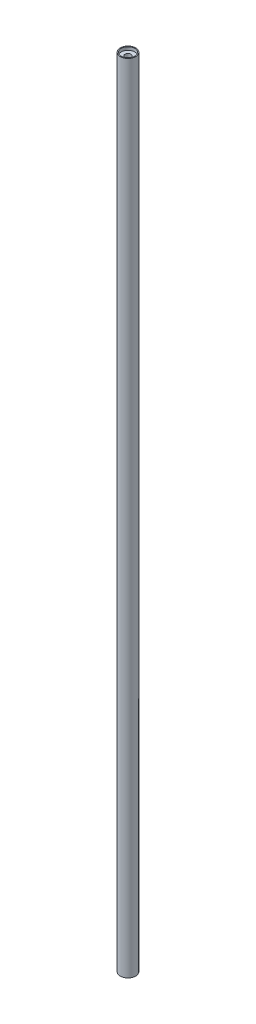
from build123d import *

# Parameters (mm, degrees)
SKETCH1_R                                           = 3.175
BOSS_EXTRUDE1_DEPTH                                 = 330.2
CBORE_FOR_00_BINDING_HEAD_MACHINE_SCREW_D           = 1.397
CBORE_FOR_00_BINDING_HEAD_MACHINE_SCREW_DEPTH       = 6.35
CBORE_FOR_00_BINDING_HEAD_MACHINE_SCREW_CBORE_D     = 3.175
CBORE_FOR_00_BINDING_HEAD_MACHINE_SCREW_CBORE_DEPTH = 0.7112
CBORE_FOR_00_BINDING_HEAD_MACHINE_SCREW_TIP         = 0.419701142
CBORE_FOR_2_BINDING_HEAD_MACHINE_SCREW1_D           = 2.4384
CBORE_FOR_2_BINDING_HEAD_MACHINE_SCREW1_DEPTH       = 6.35
CBORE_FOR_2_BINDING_HEAD_MACHINE_SCREW1_CBORE_D     = 5.55752
CBORE_FOR_2_BINDING_HEAD_MACHINE_SCREW1_CBORE_DEPTH = 1.27
CBORE_FOR_2_BINDING_HEAD_MACHINE_SCREW1_TIP         = 0.732569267


with BuildPart() as part:
    # Sketch1 → Boss-Extrude1 (new body)
    with BuildSketch(Plane(origin=(0, 0, 0), x_dir=(1, 0, 0), z_dir=(0, 1, 0))):
        with Locations(Location((0, 0, 0), (0, 0, 270))):
            Circle(SKETCH1_R)
    extrude(amount=BOSS_EXTRUDE1_DEPTH)

    # CBORE for _00 Binding Head Machine Screw
    with Locations(Plane(origin=(0, 0, 0), x_dir=(-1, 0, 0), z_dir=(0, -1, 0))):
        with Locations((0, 0)):
            CounterBoreHole(CBORE_FOR_00_BINDING_HEAD_MACHINE_SCREW_D / 2, CBORE_FOR_00_BINDING_HEAD_MACHINE_SCREW_CBORE_D / 2, CBORE_FOR_00_BINDING_HEAD_MACHINE_SCREW_CBORE_DEPTH, depth=CBORE_FOR_00_BINDING_HEAD_MACHINE_SCREW_DEPTH)
            with Locations((0, 0, -(CBORE_FOR_00_BINDING_HEAD_MACHINE_SCREW_DEPTH + CBORE_FOR_00_BINDING_HEAD_MACHINE_SCREW_TIP / 2))):  # 118° drill point
                Cone(0, CBORE_FOR_00_BINDING_HEAD_MACHINE_SCREW_D / 2, CBORE_FOR_00_BINDING_HEAD_MACHINE_SCREW_TIP, mode=Mode.SUBTRACT)

    # CBORE for _2 Binding Head Machine Screw1
    with Locations(Plane(origin=(0, 330.2, 0), x_dir=(1, 0, 0), z_dir=(0, 1, 0))):
        with Locations((0, 0)):
            CounterBoreHole(CBORE_FOR_2_BINDING_HEAD_MACHINE_SCREW1_D / 2, CBORE_FOR_2_BINDING_HEAD_MACHINE_SCREW1_CBORE_D / 2, CBORE_FOR_2_BINDING_HEAD_MACHINE_SCREW1_CBORE_DEPTH, depth=CBORE_FOR_2_BINDING_HEAD_MACHINE_SCREW1_DEPTH)
            with Locations((0, 0, -(CBORE_FOR_2_BINDING_HEAD_MACHINE_SCREW1_DEPTH + CBORE_FOR_2_BINDING_HEAD_MACHINE_SCREW1_TIP / 2))):  # 118° drill point
                Cone(0, CBORE_FOR_2_BINDING_HEAD_MACHINE_SCREW1_D / 2, CBORE_FOR_2_BINDING_HEAD_MACHINE_SCREW1_TIP, mode=Mode.SUBTRACT)


solid = part.part
